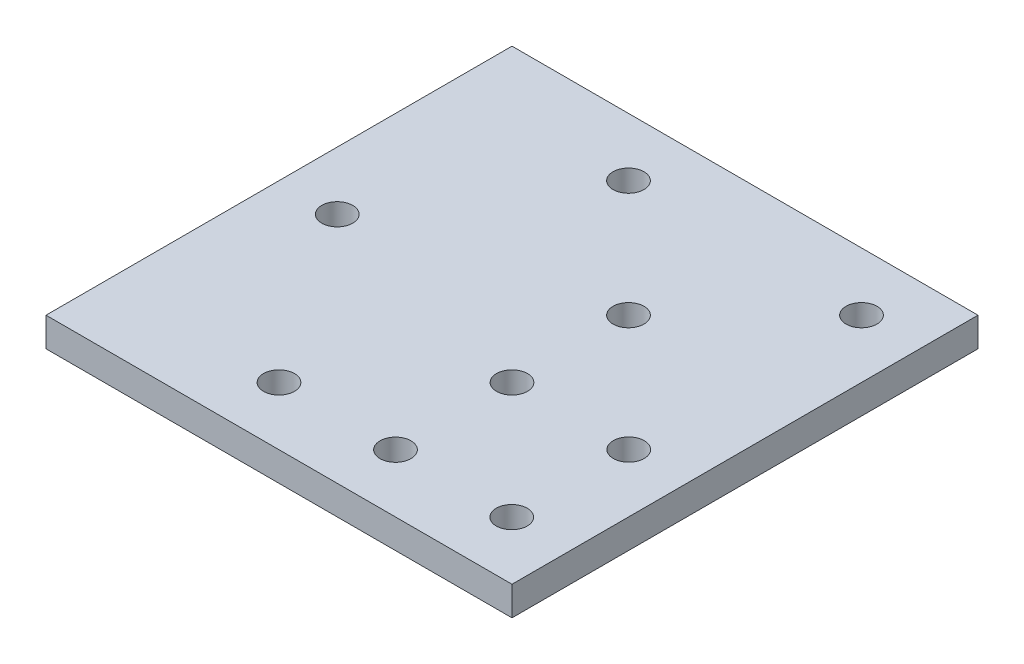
from build123d import *

# Parameters (mm, degrees)
SKETCH1_R      = 3.37312
EXTRUDE1_DEPTH = 6.35


with BuildPart() as part:
    # Sketch1 → Extrude1 (new body)
    with BuildSketch(Plane(origin=(0, 0, 0), x_dir=(1, 0, 0), z_dir=(0, 1, 0))):
        Polygon((0, 0), (101.6, 0), (101.6, 50.8), (101.6, 101.6), (0, 101.6), (0, 50.8), align=None)
        with Locations(Location((88.9, 38.153436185, 0), (0, 0, 270))):
            Circle(SKETCH1_R, mode=Mode.SUBTRACT)
        with Locations(Location((63.5, 12.7, 0), (0, 0, 270))):
            Circle(SKETCH1_R, mode=Mode.SUBTRACT)
        with Locations(Location((88.9, 88.9, 0), (0, 0, 270))):
            Circle(SKETCH1_R, mode=Mode.SUBTRACT)
        with Locations(Location((63.5, 63.5, 0), (0, 0, 270))):
            Circle(SKETCH1_R, mode=Mode.SUBTRACT)
        with Locations(Location((88.9, 12.646563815, 0), (0, 0, 90))):
            Circle(SKETCH1_R, mode=Mode.SUBTRACT)
        with Locations(Location((63.5, 38.1, 0), (0, 0, 90))):
            Circle(SKETCH1_R, mode=Mode.SUBTRACT)
        with Locations(Location((38.1, 12.7, 0), (0, 0, 90))):
            Circle(SKETCH1_R, mode=Mode.SUBTRACT)
        with Locations(Location((38.1, 88.9, 0), (0, 0, 90))):
            Circle(SKETCH1_R, mode=Mode.SUBTRACT)
        with Locations(Location((12.7, 50.8, 0), (0, 0, 90))):
            Circle(SKETCH1_R, mode=Mode.SUBTRACT)
    extrude(amount=EXTRUDE1_DEPTH)


solid = part.part
